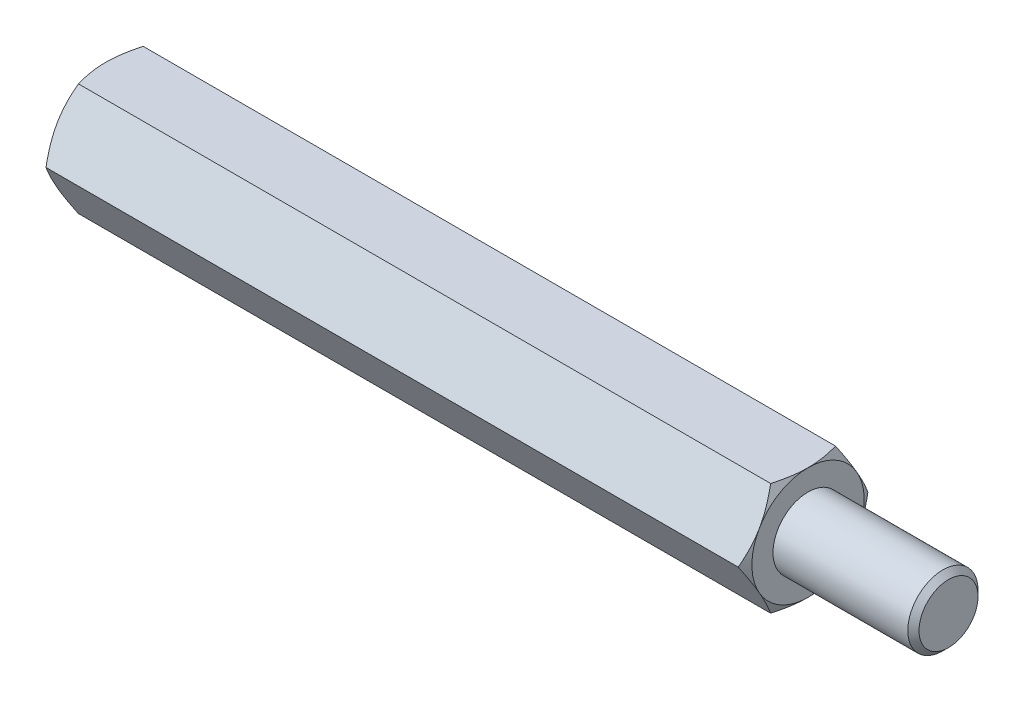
ISO-10303-21;
HEADER;
FILE_DESCRIPTION(('STEP AP214'),'2;1');
FILE_NAME('part.step','',(''),(''),'','','');
FILE_SCHEMA(('AUTOMOTIVE_DESIGN { 1 0 10303 214 1 1 1 1 }'));
ENDSEC;
DATA;
#1=APPLICATION_CONTEXT('core data for automotive mechanical design processes');
#2=APPLICATION_PROTOCOL_DEFINITION('international standard','automotive_design',2000,#1);
#3=PRODUCT_CONTEXT('',#1,'mechanical');
#4=PRODUCT('Part','Part','',(#3));
#5=PRODUCT_RELATED_PRODUCT_CATEGORY('part','',(#4));
#6=PRODUCT_DEFINITION_FORMATION('','',#4);
#7=PRODUCT_DEFINITION_CONTEXT('part definition',#1,'design');
#8=PRODUCT_DEFINITION('design','',#6,#7);
#9=PRODUCT_DEFINITION_SHAPE('','',#8);
#10=(LENGTH_UNIT() NAMED_UNIT(*) SI_UNIT(.MILLI.,.METRE.));
#11=(NAMED_UNIT(*) PLANE_ANGLE_UNIT() SI_UNIT($,.RADIAN.));
#12=(NAMED_UNIT(*) SI_UNIT($,.STERADIAN.) SOLID_ANGLE_UNIT());
#13=UNCERTAINTY_MEASURE_WITH_UNIT(LENGTH_MEASURE(1.E-05),#10,'distance_accuracy_value','');
#14=(GEOMETRIC_REPRESENTATION_CONTEXT(3) GLOBAL_UNCERTAINTY_ASSIGNED_CONTEXT((#13)) GLOBAL_UNIT_ASSIGNED_CONTEXT((#10,
#11,#12)) REPRESENTATION_CONTEXT('',''));
#15=CARTESIAN_POINT('',(0.,0.,0.));
#16=DIRECTION('',(0.,0.,1.));
#17=DIRECTION('',(1.,0.,0.));
#18=AXIS2_PLACEMENT_3D('',#15,#16,#17);
#19=CARTESIAN_POINT('',(25.,4.,-2.3094010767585));
#20=DIRECTION('',(1.,0.,0.));
#21=DIRECTION('',(0.,0.,-1.));
#22=AXIS2_PLACEMENT_3D('',#19,#20,#21);
#23=PLANE('',#22);
#24=CARTESIAN_POINT('',(25.,0.,0.));
#25=DIRECTION('',(1.,0.,0.));
#26=DIRECTION('',(0.,0.,-1.));
#27=AXIS2_PLACEMENT_3D('',#24,#25,#26);
#28=CIRCLE('',#27,4.);
#29=CARTESIAN_POINT('',(25.,-2.,-3.46410161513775));
#30=VERTEX_POINT('',#29);
#31=CARTESIAN_POINT('',(25.,2.,-3.46410161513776));
#32=VERTEX_POINT('',#31);
#33=EDGE_CURVE('E288',#30,#32,#28,.T.);
#34=ORIENTED_EDGE('',*,*,#33,.T.);
#35=CARTESIAN_POINT('',(25.,4.,0.));
#36=VERTEX_POINT('',#35);
#37=EDGE_CURVE('E53',#32,#36,#28,.T.);
#38=ORIENTED_EDGE('',*,*,#37,.T.);
#39=CARTESIAN_POINT('',(25.,2.,3.46410161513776));
#40=VERTEX_POINT('',#39);
#41=EDGE_CURVE('E296',#36,#40,#28,.T.);
#42=ORIENTED_EDGE('',*,*,#41,.T.);
#43=CARTESIAN_POINT('',(25.,-2.00000000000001,3.46410161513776));
#44=VERTEX_POINT('',#43);
#45=EDGE_CURVE('E301',#40,#44,#28,.T.);
#46=ORIENTED_EDGE('',*,*,#45,.T.);
#47=CARTESIAN_POINT('',(25.,0.,0.));
#48=DIRECTION('',(-1.,0.,0.));
#49=DIRECTION('',(0.,-1.,0.));
#50=AXIS2_PLACEMENT_3D('',#47,#48,#49);
#51=CIRCLE('',#50,4.);
#52=CARTESIAN_POINT('',(25.,-4.00000000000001,0.));
#53=VERTEX_POINT('',#52);
#54=EDGE_CURVE('E193',#53,#44,#51,.T.);
#55=ORIENTED_EDGE('',*,*,#54,.F.);
#56=EDGE_CURVE('E61',#53,#30,#28,.T.);
#57=ORIENTED_EDGE('',*,*,#56,.T.);
#58=EDGE_LOOP('',(#34,#38,#42,#46,#55,#57));
#59=FACE_BOUND('',#58,.T.);
#60=CARTESIAN_POINT('',(25.,0.,0.));
#61=DIRECTION('',(1.,0.,0.));
#62=DIRECTION('',(0.,0.,-1.));
#63=AXIS2_PLACEMENT_3D('',#60,#61,#62);
#64=CIRCLE('',#63,2.5);
#65=CARTESIAN_POINT('',(25.,0.,-2.5));
#66=VERTEX_POINT('',#65);
#67=EDGE_CURVE('E323',#66,#66,#64,.T.);
#68=ORIENTED_EDGE('',*,*,#67,.F.);
#69=EDGE_LOOP('',(#68));
#70=FACE_BOUND('',#69,.T.);
#71=ADVANCED_FACE('F37',(#59,#70),#23,.T.);
#72=CARTESIAN_POINT('',(25.,0.,-4.61880215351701));
#73=DIRECTION('',(0.,-0.5,0.866025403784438));
#74=DIRECTION('',(0.,-0.866025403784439,-0.5));
#75=AXIS2_PLACEMENT_3D('',#72,#73,#74);
#76=PLANE('',#75);
#77=CARTESIAN_POINT('',(24.6426677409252,-0.000200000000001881,-4.61891762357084));
#78=CARTESIAN_POINT('',(24.7012821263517,0.175579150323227,-4.5174314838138));
#79=CARTESIAN_POINT('',(24.7545896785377,0.352875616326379,-4.41506932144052));
#80=CARTESIAN_POINT('',(24.8476383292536,0.710538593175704,-4.2085725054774));
#81=CARTESIAN_POINT('',(24.8873465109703,0.890911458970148,-4.10443418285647));
#82=CARTESIAN_POINT('',(24.9491577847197,1.24942181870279,-3.89744813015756));
#83=CARTESIAN_POINT('',(24.9716722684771,1.42750415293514,-3.79463224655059));
#84=CARTESIAN_POINT('',(24.9985493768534,1.78450671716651,-3.58851671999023));
#85=CARTESIAN_POINT('',(25.0029342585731,1.9634256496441,-3.48521782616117));
#86=CARTESIAN_POINT('',(24.99380992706,2.29774284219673,-3.29219970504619));
#87=CARTESIAN_POINT('',(24.982541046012,2.45319115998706,-3.20245157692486));
#88=CARTESIAN_POINT('',(24.9468260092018,2.76307505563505,-3.02354002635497));
#89=CARTESIAN_POINT('',(24.9223676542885,2.91750956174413,-2.93437722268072));
#90=CARTESIAN_POINT('',(24.8612239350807,3.22803232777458,-2.75509682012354));
#91=CARTESIAN_POINT('',(24.8242793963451,3.3840812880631,-2.6650019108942));
#92=CARTESIAN_POINT('',(24.740429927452,3.69385183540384,-2.486155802));
#93=CARTESIAN_POINT('',(24.6935446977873,3.84757739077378,-2.39740231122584));
#94=CARTESIAN_POINT('',(24.6426677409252,4.0002,-2.30928560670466));
#95=B_SPLINE_CURVE_WITH_KNOTS('',3,(#77,#78,#79,#80,#81,#82,#83,#84,#85,#86,#87,#88,#89,#90,#91,
#92,#93,#94),.UNSPECIFIED.,.F.,.F.,(4,2,2,2,2,2,2,2,4),(0.,0.634047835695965,1.26961969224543,
1.88946157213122,2.50854226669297,3.04757825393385,3.58711366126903,4.13861653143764,
4.68903648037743),.UNSPECIFIED.);
#96=CARTESIAN_POINT('',(24.6427344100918,0.,-4.61880215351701));
#97=VERTEX_POINT('',#96);
#98=EDGE_CURVE('E330',#97,#32,#95,.T.);
#99=ORIENTED_EDGE('',*,*,#98,.F.);
#100=DIRECTION('',(-1.,0.,0.));
#101=VECTOR('',#100,1.);
#102=CARTESIAN_POINT('',(25.,0.,-4.61880215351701));
#103=LINE('',#102,#101);
#104=CARTESIAN_POINT('',(-24.6427344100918,0.,-4.61880215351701));
#105=VERTEX_POINT('',#104);
#106=EDGE_CURVE('E264',#97,#105,#103,.T.);
#107=ORIENTED_EDGE('',*,*,#106,.T.);
#108=CARTESIAN_POINT('',(-24.6426677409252,4.0002,-2.30928560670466));
#109=CARTESIAN_POINT('',(-24.7012821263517,3.82442084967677,-2.4107717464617));
#110=CARTESIAN_POINT('',(-24.7545896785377,3.64712438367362,-2.51313390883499));
#111=CARTESIAN_POINT('',(-24.8476383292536,3.28946140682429,-2.71963072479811));
#112=CARTESIAN_POINT('',(-24.8873465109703,3.10908854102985,-2.82376904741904));
#113=CARTESIAN_POINT('',(-24.9491577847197,2.75057818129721,-3.03075510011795));
#114=CARTESIAN_POINT('',(-24.9716722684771,2.57249584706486,-3.13357098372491));
#115=CARTESIAN_POINT('',(-24.9985493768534,2.21549328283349,-3.33968651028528));
#116=CARTESIAN_POINT('',(-25.0029342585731,2.0365743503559,-3.44298540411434));
#117=CARTESIAN_POINT('',(-24.99380992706,1.70225715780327,-3.63600352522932));
#118=CARTESIAN_POINT('',(-24.982541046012,1.54680884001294,-3.72575165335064));
#119=CARTESIAN_POINT('',(-24.9468260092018,1.23692494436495,-3.90466320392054));
#120=CARTESIAN_POINT('',(-24.9223676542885,1.08249043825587,-3.99382600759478));
#121=CARTESIAN_POINT('',(-24.8612239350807,0.771967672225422,-4.17310641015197));
#122=CARTESIAN_POINT('',(-24.8242793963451,0.615918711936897,-4.26320131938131));
#123=CARTESIAN_POINT('',(-24.740429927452,0.306148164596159,-4.4420474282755));
#124=CARTESIAN_POINT('',(-24.6935446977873,0.152422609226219,-4.53080091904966));
#125=CARTESIAN_POINT('',(-24.6426677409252,-0.000200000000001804,-4.61891762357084));
#126=B_SPLINE_CURVE_WITH_KNOTS('',3,(#108,#109,#110,#111,#112,#113,#114,#115,#116,#117,#118,
#119,#120,#121,#122,#123,#124,#125),.UNSPECIFIED.,.F.,.F.,(4,2,2,2,2,2,2,2,4),(0.,
0.634047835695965,1.26961969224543,1.88946157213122,2.50854226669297,3.04757825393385,
3.58711366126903,4.13861653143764,4.68903648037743),.UNSPECIFIED.);
#127=CARTESIAN_POINT('',(-25.,2.,-3.46410161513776));
#128=VERTEX_POINT('',#127);
#129=EDGE_CURVE('E409',#128,#105,#126,.T.);
#130=ORIENTED_EDGE('',*,*,#129,.F.);
#131=CARTESIAN_POINT('',(-24.6427344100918,4.,-2.3094010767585));
#132=VERTEX_POINT('',#131);
#133=EDGE_CURVE('E375',#132,#128,#126,.T.);
#134=ORIENTED_EDGE('',*,*,#133,.F.);
#135=DIRECTION('',(-1.,0.,0.));
#136=VECTOR('',#135,1.);
#137=CARTESIAN_POINT('',(25.,4.,-2.3094010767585));
#138=LINE('',#137,#136);
#139=CARTESIAN_POINT('',(24.642734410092,4.,-2.30940107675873));
#140=VERTEX_POINT('',#139);
#141=EDGE_CURVE('E279',#140,#132,#138,.T.);
#142=ORIENTED_EDGE('',*,*,#141,.F.);
#143=EDGE_CURVE('E229',#32,#140,#95,.T.);
#144=ORIENTED_EDGE('',*,*,#143,.F.);
#145=EDGE_LOOP('',(#99,#107,#130,#134,#142,#144));
#146=FACE_BOUND('',#145,.T.);
#147=ADVANCED_FACE('F148',(#146),#76,.F.);
#148=CARTESIAN_POINT('',(25.,4.,-2.3094010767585));
#149=DIRECTION('',(0.,-1.,0.));
#150=DIRECTION('',(0.,0.,-1.));
#151=AXIS2_PLACEMENT_3D('',#148,#149,#150);
#152=PLANE('',#151);
#153=CARTESIAN_POINT('',(23.0082907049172,4.,-6.28479524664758));
#154=CARTESIAN_POINT('',(23.0937006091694,4.,-6.10939349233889));
#155=CARTESIAN_POINT('',(23.1783148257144,4.,-5.93359774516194));
#156=CARTESIAN_POINT('',(23.3455059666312,4.,-5.58100905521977));
#157=CARTESIAN_POINT('',(23.4280825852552,4.,-5.40421596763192));
#158=CARTESIAN_POINT('',(23.5911508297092,4.,-5.04855089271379));
#159=CARTESIAN_POINT('',(23.6716293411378,4.,-4.86967287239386));
#160=CARTESIAN_POINT('',(23.829400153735,4.,-4.51052237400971));
#161=CARTESIAN_POINT('',(23.906692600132,4.,-4.33024995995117));
#162=CARTESIAN_POINT('',(24.059802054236,4.,-3.96189114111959));
#163=CARTESIAN_POINT('',(24.135480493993,4.,-3.77374683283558));
#164=CARTESIAN_POINT('',(24.2813045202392,4.,-3.39528725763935));
#165=CARTESIAN_POINT('',(24.3514494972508,4.,-3.2049717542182));
#166=CARTESIAN_POINT('',(24.4844245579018,4.,-2.82219775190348));
#167=CARTESIAN_POINT('',(24.5472687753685,4.,-2.62974421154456));
#168=CARTESIAN_POINT('',(24.6636796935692,4.,-2.24207725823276));
#169=CARTESIAN_POINT('',(24.7172492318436,4.,-2.04686470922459));
#170=CARTESIAN_POINT('',(24.8123031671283,4.,-1.65467425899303));
#171=CARTESIAN_POINT('',(24.8538563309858,4.,-1.45771333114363));
#172=CARTESIAN_POINT('',(24.9225903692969,4.,-1.06125849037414));
#173=CARTESIAN_POINT('',(24.9497727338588,4.,-0.861764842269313));
#174=CARTESIAN_POINT('',(24.9872447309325,4.,-0.463879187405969));
#175=CARTESIAN_POINT('',(24.9977578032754,4.,-0.265508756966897));
#176=CARTESIAN_POINT('',(25.0015934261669,4.,0.131417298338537));
#177=CARTESIAN_POINT('',(24.9949158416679,4.,0.329972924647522));
#178=CARTESIAN_POINT('',(24.9696489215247,4.,0.664692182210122));
#179=CARTESIAN_POINT('',(24.9553708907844,4.,0.801202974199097));
#180=CARTESIAN_POINT('',(24.9195349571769,4.,1.07327201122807));
#181=CARTESIAN_POINT('',(24.8979761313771,4.,1.20883013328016));
#182=CARTESIAN_POINT('',(24.8235066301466,4.,1.61386939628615));
#183=CARTESIAN_POINT('',(24.7608149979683,4.,1.88157484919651));
#184=CARTESIAN_POINT('',(24.6515117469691,4.,2.28197262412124));
#185=CARTESIAN_POINT('',(24.612009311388,4.,2.41672443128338));
#186=CARTESIAN_POINT('',(24.5287523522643,4.,2.68492067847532));
#187=CARTESIAN_POINT('',(24.4849977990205,4.,2.81836510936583));
#188=CARTESIAN_POINT('',(24.3939510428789,4.,3.08398596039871));
#189=CARTESIAN_POINT('',(24.346659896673,4.,3.21616274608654));
#190=CARTESIAN_POINT('',(24.2491111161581,4.,3.47941134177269));
#191=CARTESIAN_POINT('',(24.1988535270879,4.,3.61048316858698));
#192=CARTESIAN_POINT('',(24.0713295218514,4.,3.93385125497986));
#193=CARTESIAN_POINT('',(23.9926014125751,4.,4.12557021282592));
#194=CARTESIAN_POINT('',(23.8309693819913,4.,4.50724553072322));
#195=CARTESIAN_POINT('',(23.7480651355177,4.,4.69720175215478));
#196=CARTESIAN_POINT('',(23.5789699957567,4.,5.07569950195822));
#197=CARTESIAN_POINT('',(23.4927782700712,4.,5.26424065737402));
#198=CARTESIAN_POINT('',(23.3178011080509,4.,5.64011758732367));
#199=CARTESIAN_POINT('',(23.2290156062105,4.,5.82745333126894));
#200=CARTESIAN_POINT('',(22.9593432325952,4.,6.38844423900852));
#201=CARTESIAN_POINT('',(22.7753561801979,4.,6.76060781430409));
#202=CARTESIAN_POINT('',(22.4019562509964,4.,7.50211228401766));
#203=CARTESIAN_POINT('',(22.2125442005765,4.,7.87145359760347));
#204=CARTESIAN_POINT('',(21.8473877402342,4.,8.57450173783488));
#205=CARTESIAN_POINT('',(21.671975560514,4.,8.90838144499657));
#206=CARTESIAN_POINT('',(21.3188097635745,4.,9.57491712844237));
#207=CARTESIAN_POINT('',(21.1410560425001,4.,9.90757304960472));
#208=CARTESIAN_POINT('',(20.7842933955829,4.,10.5709822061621));
#209=CARTESIAN_POINT('',(20.6052895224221,3.99999999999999,10.9017381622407));
#210=CARTESIAN_POINT('',(20.2459071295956,3.99999999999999,11.5624752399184));
#211=CARTESIAN_POINT('',(20.0655286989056,3.99999999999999,11.8924564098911));
#212=CARTESIAN_POINT('',(19.884642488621,3.99999999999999,12.2221569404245));
#213=B_SPLINE_CURVE_WITH_KNOTS('',3,(#153,#154,#155,#156,#157,#158,#159,#160,#161,#162,#163,
#164,#165,#166,#167,#168,#169,#170,#171,#172,#173,#174,#175,#176,#177,#178,#179,#180,#181,#182,
#183,#184,#185,#186,#187,#188,#189,#190,#191,#192,#193,#194,#195,#196,#197,#198,#199,#200,#201,
#202,#203,#204,#205,#206,#207,#208,#209,#210,#211,#212),.UNSPECIFIED.,.F.,.F.,(4,2,2,2,2,2,2,2,
2,2,2,2,2,2,2,2,2,2,2,2,2,2,2,2,2,2,2,2,2,4),(0.,0.585280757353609,1.17064881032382,
1.75906864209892,2.34746162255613,2.9557770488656,3.56415938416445,4.17134357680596,
4.77834167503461,5.38179402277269,5.98518378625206,6.58041501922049,7.17565092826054,
7.5872191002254,7.99883946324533,8.82250155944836,9.24373134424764,9.6649640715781,
10.086071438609,10.5071723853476,11.1288656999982,11.7506074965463,12.3725077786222,
12.9944237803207,14.2398211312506,15.4850297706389,16.6164791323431,17.7479788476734,
18.8762380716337,20.0044248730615),.UNSPECIFIED.);
#214=EDGE_CURVE('E227',#140,#36,#213,.T.);
#215=ORIENTED_EDGE('',*,*,#214,.F.);
#216=ORIENTED_EDGE('',*,*,#141,.T.);
#217=CARTESIAN_POINT('',(-23.0082907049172,4.,-6.28479524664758));
#218=CARTESIAN_POINT('',(-23.0937006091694,4.,-6.10939349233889));
#219=CARTESIAN_POINT('',(-23.1783148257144,4.,-5.93359774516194));
#220=CARTESIAN_POINT('',(-23.3455059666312,4.,-5.58100905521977));
#221=CARTESIAN_POINT('',(-23.4280825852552,4.,-5.40421596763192));
#222=CARTESIAN_POINT('',(-23.5911508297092,4.,-5.04855089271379));
#223=CARTESIAN_POINT('',(-23.6716293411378,4.,-4.86967287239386));
#224=CARTESIAN_POINT('',(-23.829400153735,4.,-4.51052237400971));
#225=CARTESIAN_POINT('',(-23.906692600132,4.,-4.33024995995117));
#226=CARTESIAN_POINT('',(-24.059802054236,4.,-3.96189114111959));
#227=CARTESIAN_POINT('',(-24.135480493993,4.,-3.77374683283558));
#228=CARTESIAN_POINT('',(-24.2813045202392,4.,-3.39528725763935));
#229=CARTESIAN_POINT('',(-24.3514494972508,4.,-3.2049717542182));
#230=CARTESIAN_POINT('',(-24.4844245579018,4.,-2.82219775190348));
#231=CARTESIAN_POINT('',(-24.5472687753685,4.,-2.62974421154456));
#232=CARTESIAN_POINT('',(-24.6636796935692,4.,-2.24207725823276));
#233=CARTESIAN_POINT('',(-24.7172492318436,4.,-2.04686470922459));
#234=CARTESIAN_POINT('',(-24.8123031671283,4.,-1.65467425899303));
#235=CARTESIAN_POINT('',(-24.8538563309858,4.,-1.45771333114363));
#236=CARTESIAN_POINT('',(-24.9225903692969,4.,-1.06125849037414));
#237=CARTESIAN_POINT('',(-24.9497727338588,4.,-0.861764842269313));
#238=CARTESIAN_POINT('',(-24.9872447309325,4.,-0.463879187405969));
#239=CARTESIAN_POINT('',(-24.9977578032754,4.,-0.265508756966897));
#240=CARTESIAN_POINT('',(-25.0015934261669,4.,0.131417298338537));
#241=CARTESIAN_POINT('',(-24.9949158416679,4.,0.329972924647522));
#242=CARTESIAN_POINT('',(-24.9696489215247,4.,0.664692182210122));
#243=CARTESIAN_POINT('',(-24.9553708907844,4.,0.801202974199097));
#244=CARTESIAN_POINT('',(-24.9195349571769,4.,1.07327201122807));
#245=CARTESIAN_POINT('',(-24.8979761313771,4.,1.20883013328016));
#246=CARTESIAN_POINT('',(-24.8235066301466,4.,1.61386939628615));
#247=CARTESIAN_POINT('',(-24.7608149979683,4.,1.88157484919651));
#248=CARTESIAN_POINT('',(-24.6515117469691,4.,2.28197262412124));
#249=CARTESIAN_POINT('',(-24.612009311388,4.,2.41672443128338));
#250=CARTESIAN_POINT('',(-24.5287523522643,4.,2.68492067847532));
#251=CARTESIAN_POINT('',(-24.4849977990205,4.,2.81836510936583));
#252=CARTESIAN_POINT('',(-24.3939510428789,4.,3.08398596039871));
#253=CARTESIAN_POINT('',(-24.346659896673,4.,3.21616274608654));
#254=CARTESIAN_POINT('',(-24.2491111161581,4.,3.47941134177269));
#255=CARTESIAN_POINT('',(-24.1988535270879,4.,3.61048316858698));
#256=CARTESIAN_POINT('',(-24.0713295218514,4.,3.93385125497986));
#257=CARTESIAN_POINT('',(-23.9926014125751,4.,4.12557021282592));
#258=CARTESIAN_POINT('',(-23.8309693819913,4.,4.50724553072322));
#259=CARTESIAN_POINT('',(-23.7480651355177,4.,4.69720175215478));
#260=CARTESIAN_POINT('',(-23.5789699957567,4.,5.07569950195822));
#261=CARTESIAN_POINT('',(-23.4927782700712,4.,5.26424065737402));
#262=CARTESIAN_POINT('',(-23.3178011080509,4.,5.64011758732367));
#263=CARTESIAN_POINT('',(-23.2290156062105,4.,5.82745333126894));
#264=CARTESIAN_POINT('',(-22.9593432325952,4.,6.38844423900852));
#265=CARTESIAN_POINT('',(-22.7753561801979,4.,6.76060781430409));
#266=CARTESIAN_POINT('',(-22.4019562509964,4.,7.50211228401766));
#267=CARTESIAN_POINT('',(-22.2125442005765,4.,7.87145359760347));
#268=CARTESIAN_POINT('',(-21.8473877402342,4.,8.57450173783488));
#269=CARTESIAN_POINT('',(-21.671975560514,4.,8.90838144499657));
#270=CARTESIAN_POINT('',(-21.3188097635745,4.,9.57491712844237));
#271=CARTESIAN_POINT('',(-21.1410560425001,4.,9.90757304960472));
#272=CARTESIAN_POINT('',(-20.7842933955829,4.,10.5709822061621));
#273=CARTESIAN_POINT('',(-20.6052895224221,3.99999999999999,10.9017381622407));
#274=CARTESIAN_POINT('',(-20.2459071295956,3.99999999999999,11.5624752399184));
#275=CARTESIAN_POINT('',(-20.0655286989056,3.99999999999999,11.8924564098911));
#276=CARTESIAN_POINT('',(-19.884642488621,3.99999999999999,12.2221569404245));
#277=B_SPLINE_CURVE_WITH_KNOTS('',3,(#217,#218,#219,#220,#221,#222,#223,#224,#225,#226,#227,
#228,#229,#230,#231,#232,#233,#234,#235,#236,#237,#238,#239,#240,#241,#242,#243,#244,#245,#246,
#247,#248,#249,#250,#251,#252,#253,#254,#255,#256,#257,#258,#259,#260,#261,#262,#263,#264,#265,
#266,#267,#268,#269,#270,#271,#272,#273,#274,#275,#276),.UNSPECIFIED.,.F.,.F.,(4,2,2,2,2,2,2,2,
2,2,2,2,2,2,2,2,2,2,2,2,2,2,2,2,2,2,2,2,2,4),(0.,0.585280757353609,1.17064881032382,
1.75906864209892,2.34746162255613,2.9557770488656,3.56415938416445,4.17134357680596,
4.77834167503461,5.38179402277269,5.98518378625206,6.58041501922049,7.17565092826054,
7.5872191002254,7.99883946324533,8.82250155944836,9.24373134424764,9.6649640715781,
10.086071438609,10.5071723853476,11.1288656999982,11.7506074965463,12.3725077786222,
12.9944237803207,14.2398211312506,15.4850297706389,16.6164791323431,17.7479788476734,
18.8762380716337,20.0044248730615),.UNSPECIFIED.);
#278=CARTESIAN_POINT('',(-25.,4.,0.));
#279=VERTEX_POINT('',#278);
#280=EDGE_CURVE('E241',#279,#132,#277,.F.);
#281=ORIENTED_EDGE('',*,*,#280,.F.);
#282=CARTESIAN_POINT('',(-24.6427344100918,4.,2.3094010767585));
#283=VERTEX_POINT('',#282);
#284=EDGE_CURVE('E249',#283,#279,#277,.F.);
#285=ORIENTED_EDGE('',*,*,#284,.F.);
#286=DIRECTION('',(-1.,0.,0.));
#287=VECTOR('',#286,1.);
#288=CARTESIAN_POINT('',(25.,4.,2.3094010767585));
#289=LINE('',#288,#287);
#290=CARTESIAN_POINT('',(24.6427344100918,4.,2.3094010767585));
#291=VERTEX_POINT('',#290);
#292=EDGE_CURVE('E276',#291,#283,#289,.T.);
#293=ORIENTED_EDGE('',*,*,#292,.F.);
#294=EDGE_CURVE('E221',#36,#291,#213,.T.);
#295=ORIENTED_EDGE('',*,*,#294,.F.);
#296=EDGE_LOOP('',(#215,#216,#281,#285,#293,#295));
#297=FACE_BOUND('',#296,.T.);
#298=ADVANCED_FACE('F153',(#297),#152,.F.);
#299=CARTESIAN_POINT('',(25.,4.,2.3094010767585));
#300=DIRECTION('',(0.,-0.5,-0.866025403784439));
#301=DIRECTION('',(0.,0.866025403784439,-0.5));
#302=AXIS2_PLACEMENT_3D('',#299,#300,#301);
#303=PLANE('',#302);
#304=CARTESIAN_POINT('',(24.6426677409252,4.0002,2.30928560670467));
#305=CARTESIAN_POINT('',(24.7012821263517,3.82442084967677,2.41077174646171));
#306=CARTESIAN_POINT('',(24.7545896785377,3.64712438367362,2.51313390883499));
#307=CARTESIAN_POINT('',(24.8476383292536,3.28946140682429,2.71963072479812));
#308=CARTESIAN_POINT('',(24.8873465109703,3.10908854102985,2.82376904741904));
#309=CARTESIAN_POINT('',(24.9491577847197,2.75057818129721,3.03075510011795));
#310=CARTESIAN_POINT('',(24.9716722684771,2.57249584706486,3.13357098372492));
#311=CARTESIAN_POINT('',(24.9985493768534,2.21549328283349,3.33968651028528));
#312=CARTESIAN_POINT('',(25.0029342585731,2.0365743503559,3.44298540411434));
#313=CARTESIAN_POINT('',(24.99380992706,1.70225715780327,3.63600352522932));
#314=CARTESIAN_POINT('',(24.982541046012,1.54680884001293,3.72575165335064));
#315=CARTESIAN_POINT('',(24.9468260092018,1.23692494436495,3.90466320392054));
#316=CARTESIAN_POINT('',(24.9223676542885,1.08249043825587,3.99382600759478));
#317=CARTESIAN_POINT('',(24.8612239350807,0.771967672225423,4.17310641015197));
#318=CARTESIAN_POINT('',(24.8242793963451,0.615918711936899,4.26320131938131));
#319=CARTESIAN_POINT('',(24.740429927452,0.306148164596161,4.4420474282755));
#320=CARTESIAN_POINT('',(24.6935446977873,0.152422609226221,4.53080091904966));
#321=CARTESIAN_POINT('',(24.6426677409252,-0.000199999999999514,4.61891762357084));
#322=B_SPLINE_CURVE_WITH_KNOTS('',3,(#304,#305,#306,#307,#308,#309,#310,#311,#312,#313,#314,
#315,#316,#317,#318,#319,#320,#321),.UNSPECIFIED.,.F.,.F.,(4,2,2,2,2,2,2,2,4),(0.,
0.634047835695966,1.26961969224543,1.88946157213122,2.50854226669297,3.04757825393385,
3.58711366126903,4.13861653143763,4.68903648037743),.UNSPECIFIED.);
#323=EDGE_CURVE('E228',#291,#40,#322,.T.);
#324=ORIENTED_EDGE('',*,*,#323,.F.);
#325=ORIENTED_EDGE('',*,*,#292,.T.);
#326=CARTESIAN_POINT('',(-24.6426677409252,-0.000199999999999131,4.61891762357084));
#327=CARTESIAN_POINT('',(-24.7012821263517,0.175579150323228,4.5174314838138));
#328=CARTESIAN_POINT('',(-24.7545896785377,0.352875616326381,4.41506932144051));
#329=CARTESIAN_POINT('',(-24.8476383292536,0.710538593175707,4.20857250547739));
#330=CARTESIAN_POINT('',(-24.8873465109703,0.890911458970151,4.10443418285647));
#331=CARTESIAN_POINT('',(-24.9491577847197,1.24942181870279,3.89744813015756));
#332=CARTESIAN_POINT('',(-24.9716722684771,1.42750415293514,3.79463224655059));
#333=CARTESIAN_POINT('',(-24.9985493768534,1.78450671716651,3.58851671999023));
#334=CARTESIAN_POINT('',(-25.0029342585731,1.9634256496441,3.48521782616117));
#335=CARTESIAN_POINT('',(-24.99380992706,2.29774284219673,3.29219970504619));
#336=CARTESIAN_POINT('',(-24.982541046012,2.45319115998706,3.20245157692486));
#337=CARTESIAN_POINT('',(-24.9468260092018,2.76307505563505,3.02354002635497));
#338=CARTESIAN_POINT('',(-24.9223676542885,2.91750956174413,2.93437722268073));
#339=CARTESIAN_POINT('',(-24.8612239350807,3.22803232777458,2.75509682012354));
#340=CARTESIAN_POINT('',(-24.8242793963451,3.3840812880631,2.6650019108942));
#341=CARTESIAN_POINT('',(-24.740429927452,3.69385183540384,2.48615580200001));
#342=CARTESIAN_POINT('',(-24.6935446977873,3.84757739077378,2.39740231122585));
#343=CARTESIAN_POINT('',(-24.6426677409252,4.0002,2.30928560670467));
#344=B_SPLINE_CURVE_WITH_KNOTS('',3,(#326,#327,#328,#329,#330,#331,#332,#333,#334,#335,#336,
#337,#338,#339,#340,#341,#342,#343),.UNSPECIFIED.,.F.,.F.,(4,2,2,2,2,2,2,2,4),(0.,
0.634047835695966,1.26961969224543,1.88946157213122,2.50854226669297,3.04757825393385,
3.58711366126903,4.13861653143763,4.68903648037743),.UNSPECIFIED.);
#345=CARTESIAN_POINT('',(-25.,2.,3.46410161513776));
#346=VERTEX_POINT('',#345);
#347=EDGE_CURVE('E255',#346,#283,#344,.T.);
#348=ORIENTED_EDGE('',*,*,#347,.F.);
#349=CARTESIAN_POINT('',(-24.6427344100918,0.,4.618802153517));
#350=VERTEX_POINT('',#349);
#351=EDGE_CURVE('E262',#350,#346,#344,.T.);
#352=ORIENTED_EDGE('',*,*,#351,.F.);
#353=DIRECTION('',(-1.,0.,0.));
#354=VECTOR('',#353,1.);
#355=CARTESIAN_POINT('',(25.,0.,4.618802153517));
#356=LINE('',#355,#354);
#357=CARTESIAN_POINT('',(24.6427344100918,0.,4.618802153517));
#358=VERTEX_POINT('',#357);
#359=EDGE_CURVE('E273',#358,#350,#356,.T.);
#360=ORIENTED_EDGE('',*,*,#359,.F.);
#361=EDGE_CURVE('E215',#40,#358,#322,.T.);
#362=ORIENTED_EDGE('',*,*,#361,.F.);
#363=EDGE_LOOP('',(#324,#325,#348,#352,#360,#362));
#364=FACE_BOUND('',#363,.T.);
#365=ADVANCED_FACE('F235',(#364),#303,.F.);
#366=CARTESIAN_POINT('',(25.,0.,4.618802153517));
#367=DIRECTION('',(0.,0.5,-0.866025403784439));
#368=DIRECTION('',(0.,0.866025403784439,0.5));
#369=AXIS2_PLACEMENT_3D('',#366,#367,#368);
#370=PLANE('',#369);
#371=CARTESIAN_POINT('',(24.6426677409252,0.00020000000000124,4.61891762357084));
#372=CARTESIAN_POINT('',(24.7012821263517,-0.175579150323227,4.5174314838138));
#373=CARTESIAN_POINT('',(24.7545896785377,-0.352875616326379,4.41506932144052));
#374=CARTESIAN_POINT('',(24.8476383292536,-0.710538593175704,4.20857250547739));
#375=CARTESIAN_POINT('',(24.8873465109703,-0.890911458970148,4.10443418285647));
#376=CARTESIAN_POINT('',(24.9491577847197,-1.24942181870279,3.89744813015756));
#377=CARTESIAN_POINT('',(24.9716722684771,-1.42750415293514,3.79463224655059));
#378=CARTESIAN_POINT('',(24.9985493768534,-1.78450671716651,3.58851671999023));
#379=CARTESIAN_POINT('',(25.0029342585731,-1.9634256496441,3.48521782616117));
#380=CARTESIAN_POINT('',(24.99380992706,-2.29774284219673,3.29219970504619));
#381=CARTESIAN_POINT('',(24.982541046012,-2.45319115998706,3.20245157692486));
#382=CARTESIAN_POINT('',(24.9468260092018,-2.76307505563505,3.02354002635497));
#383=CARTESIAN_POINT('',(24.9223676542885,-2.91750956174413,2.93437722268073));
#384=CARTESIAN_POINT('',(24.8612239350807,-3.22803232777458,2.75509682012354));
#385=CARTESIAN_POINT('',(24.8242793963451,-3.3840812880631,2.6650019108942));
#386=CARTESIAN_POINT('',(24.740429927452,-3.69385183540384,2.48615580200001));
#387=CARTESIAN_POINT('',(24.6935446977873,-3.84757739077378,2.39740231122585));
#388=CARTESIAN_POINT('',(24.6426677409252,-4.0002,2.30928560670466));
#389=B_SPLINE_CURVE_WITH_KNOTS('',3,(#371,#372,#373,#374,#375,#376,#377,#378,#379,#380,#381,
#382,#383,#384,#385,#386,#387,#388),.UNSPECIFIED.,.F.,.F.,(4,2,2,2,2,2,2,2,4),(0.,
0.634047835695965,1.26961969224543,1.88946157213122,2.50854226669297,3.04757825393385,
3.58711366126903,4.13861653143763,4.68903648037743),.UNSPECIFIED.);
#390=EDGE_CURVE('E350',#358,#44,#389,.T.);
#391=ORIENTED_EDGE('',*,*,#390,.F.);
#392=ORIENTED_EDGE('',*,*,#359,.T.);
#393=CARTESIAN_POINT('',(-24.6426677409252,-4.0002,2.30928560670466));
#394=CARTESIAN_POINT('',(-24.7012821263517,-3.82442084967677,2.4107717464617));
#395=CARTESIAN_POINT('',(-24.7545896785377,-3.64712438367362,2.51313390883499));
#396=CARTESIAN_POINT('',(-24.8476383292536,-3.2894614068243,2.71963072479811));
#397=CARTESIAN_POINT('',(-24.8873465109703,-3.10908854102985,2.82376904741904));
#398=CARTESIAN_POINT('',(-24.9491577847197,-2.75057818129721,3.03075510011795));
#399=CARTESIAN_POINT('',(-24.9716722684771,-2.57249584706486,3.13357098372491));
#400=CARTESIAN_POINT('',(-24.9985493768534,-2.2154932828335,3.33968651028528));
#401=CARTESIAN_POINT('',(-25.0029342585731,-2.03657435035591,3.44298540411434));
#402=CARTESIAN_POINT('',(-24.99380992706,-1.70225715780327,3.63600352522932));
#403=CARTESIAN_POINT('',(-24.982541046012,-1.54680884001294,3.72575165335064));
#404=CARTESIAN_POINT('',(-24.9468260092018,-1.23692494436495,3.90466320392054));
#405=CARTESIAN_POINT('',(-24.9223676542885,-1.08249043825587,3.99382600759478));
#406=CARTESIAN_POINT('',(-24.8612239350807,-0.771967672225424,4.17310641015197));
#407=CARTESIAN_POINT('',(-24.8242793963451,-0.615918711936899,4.26320131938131));
#408=CARTESIAN_POINT('',(-24.740429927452,-0.306148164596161,4.4420474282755));
#409=CARTESIAN_POINT('',(-24.6935446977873,-0.152422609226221,4.53080091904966));
#410=CARTESIAN_POINT('',(-24.6426677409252,0.000200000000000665,4.61891762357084));
#411=B_SPLINE_CURVE_WITH_KNOTS('',3,(#393,#394,#395,#396,#397,#398,#399,#400,#401,#402,#403,
#404,#405,#406,#407,#408,#409,#410),.UNSPECIFIED.,.F.,.F.,(4,2,2,2,2,2,2,2,4),(0.,
0.634047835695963,1.26961969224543,1.88946157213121,2.50854226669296,3.04757825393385,
3.58711366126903,4.13861653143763,4.68903648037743),.UNSPECIFIED.);
#412=CARTESIAN_POINT('',(-25.,-2.00000000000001,3.46410161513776));
#413=VERTEX_POINT('',#412);
#414=EDGE_CURVE('E263',#413,#350,#411,.T.);
#415=ORIENTED_EDGE('',*,*,#414,.F.);
#416=CARTESIAN_POINT('',(-24.6427344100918,-4.,2.3094010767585));
#417=VERTEX_POINT('',#416);
#418=EDGE_CURVE('E250',#417,#413,#411,.T.);
#419=ORIENTED_EDGE('',*,*,#418,.F.);
#420=DIRECTION('',(-1.,0.,0.));
#421=VECTOR('',#420,1.);
#422=CARTESIAN_POINT('',(25.,-4.,2.3094010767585));
#423=LINE('',#422,#421);
#424=CARTESIAN_POINT('',(24.6427344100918,-4.,2.3094010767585));
#425=VERTEX_POINT('',#424);
#426=EDGE_CURVE('E270',#425,#417,#423,.T.);
#427=ORIENTED_EDGE('',*,*,#426,.F.);
#428=EDGE_CURVE('E210',#44,#425,#389,.T.);
#429=ORIENTED_EDGE('',*,*,#428,.F.);
#430=EDGE_LOOP('',(#391,#392,#415,#419,#427,#429));
#431=FACE_BOUND('',#430,.T.);
#432=ADVANCED_FACE('F445',(#431),#370,.F.);
#433=CARTESIAN_POINT('',(25.,-4.,2.3094010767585));
#434=DIRECTION('',(0.,1.,0.));
#435=DIRECTION('',(0.,0.,1.));
#436=AXIS2_PLACEMENT_3D('',#433,#434,#435);
#437=PLANE('',#436);
#438=CARTESIAN_POINT('',(23.0082907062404,-4.,-6.28479524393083));
#439=CARTESIAN_POINT('',(23.0937006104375,-4.,-6.10939348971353));
#440=CARTESIAN_POINT('',(23.1783148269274,-4.,-5.93359774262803));
#441=CARTESIAN_POINT('',(23.3455059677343,-4.,-5.58100905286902));
#442=CARTESIAN_POINT('',(23.4280825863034,-4.,-5.4042159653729));
#443=CARTESIAN_POINT('',(23.5911508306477,-4.,-5.04855089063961));
#444=CARTESIAN_POINT('',(23.6716293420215,-4.,-4.8696728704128));
#445=CARTESIAN_POINT('',(23.8294001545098,-4.,-4.51052237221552));
#446=CARTESIAN_POINT('',(23.9066926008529,-4.,-4.33024995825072));
#447=CARTESIAN_POINT('',(24.0598020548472,-4.,-3.96189113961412));
#448=CARTESIAN_POINT('',(24.1354804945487,-4.,-3.77374683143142));
#449=CARTESIAN_POINT('',(24.2813045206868,-4.,-3.39528725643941));
#450=CARTESIAN_POINT('',(24.3514494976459,-4.,-3.20497175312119));
#451=CARTESIAN_POINT('',(24.4844245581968,-4.,-2.82219775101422));
#452=CARTESIAN_POINT('',(24.5472687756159,-4.,-2.62974421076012));
#453=CARTESIAN_POINT('',(24.6636796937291,-4.,-2.24207725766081));
#454=CARTESIAN_POINT('',(24.7172492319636,-4.,-2.0468647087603));
#455=CARTESIAN_POINT('',(24.8123031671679,-4.,-1.65467425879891));
#456=CARTESIAN_POINT('',(24.8538563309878,-4.,-1.45771333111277));
#457=CARTESIAN_POINT('',(24.9225903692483,-4.,-1.06125849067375));
#458=CARTESIAN_POINT('',(24.9497727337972,-4.,-0.861764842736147));
#459=CARTESIAN_POINT('',(24.9872447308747,-4.,-0.463879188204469));
#460=CARTESIAN_POINT('',(24.9977578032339,-4.,-0.265508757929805));
#461=CARTESIAN_POINT('',(25.0015934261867,-4.,0.131417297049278));
#462=CARTESIAN_POINT('',(24.9949158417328,-4.,0.329972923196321));
#463=CARTESIAN_POINT('',(24.9696489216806,-4.,0.664692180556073));
#464=CARTESIAN_POINT('',(24.9553708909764,-4.,0.801202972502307));
#465=CARTESIAN_POINT('',(24.9195349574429,-4.,1.07327200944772));
#466=CARTESIAN_POINT('',(24.8979761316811,-4.,1.20883013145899));
#467=CARTESIAN_POINT('',(24.8235066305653,-4.,1.6138693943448));
#468=CARTESIAN_POINT('',(24.7608149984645,-4.,1.88157484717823));
#469=CARTESIAN_POINT('',(24.6515117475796,-4.,2.28197262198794));
#470=CARTESIAN_POINT('',(24.6120093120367,-4.,2.41672442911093));
#471=CARTESIAN_POINT('',(24.5287523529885,-4.,2.68492067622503));
#472=CARTESIAN_POINT('',(24.4849977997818,-4.,2.81836510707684));
#473=CARTESIAN_POINT('',(24.3939510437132,-4.,3.0839859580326));
#474=CARTESIAN_POINT('',(24.3466598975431,-4.,3.21616274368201));
#475=CARTESIAN_POINT('',(24.2491111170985,-4.,3.47941133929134));
#476=CARTESIAN_POINT('',(24.1988535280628,-4.,3.61048316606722));
#477=CARTESIAN_POINT('',(24.0713295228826,-4.,3.93385125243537));
#478=CARTESIAN_POINT('',(23.9926014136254,-4.,4.12557021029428));
#479=CARTESIAN_POINT('',(23.830969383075,-4.,4.50724552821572));
#480=CARTESIAN_POINT('',(23.7480651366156,-4.,4.69720174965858));
#481=CARTESIAN_POINT('',(23.5789699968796,-4.,5.07569949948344));
#482=CARTESIAN_POINT('',(23.4927782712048,-4.,5.26424065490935));
#483=CARTESIAN_POINT('',(23.3178011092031,-4.,5.64011758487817));
#484=CARTESIAN_POINT('',(23.2290156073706,-4.,5.8274533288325));
#485=CARTESIAN_POINT('',(22.9593432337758,-4.,6.38844423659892));
#486=CARTESIAN_POINT('',(22.775356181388,-4.,6.76060781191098));
#487=CARTESIAN_POINT('',(22.4019562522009,-4.,7.50211228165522));
#488=CARTESIAN_POINT('',(22.2125442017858,-4.,7.87145359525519));
#489=CARTESIAN_POINT('',(21.8473877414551,-4.,8.57450173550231));
#490=CARTESIAN_POINT('',(21.671975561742,-4.,8.90838144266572));
#491=CARTESIAN_POINT('',(21.3188097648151,-4.,9.57491712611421));
#492=CARTESIAN_POINT('',(21.1410560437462,-4.,9.90757304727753));
#493=CARTESIAN_POINT('',(20.78429339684,-4.,10.5709822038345));
#494=CARTESIAN_POINT('',(20.6052895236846,-4.,10.9017381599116));
#495=CARTESIAN_POINT('',(20.2459071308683,-4.,11.562475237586));
#496=CARTESIAN_POINT('',(20.065528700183,-4.,11.8924564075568));
#497=CARTESIAN_POINT('',(19.884642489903,-4.,12.2221569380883));
#498=B_SPLINE_CURVE_WITH_KNOTS('',3,(#438,#439,#440,#441,#442,#443,#444,#445,#446,#447,#448,
#449,#450,#451,#452,#453,#454,#455,#456,#457,#458,#459,#460,#461,#462,#463,#464,#465,#466,#467,
#468,#469,#470,#471,#472,#473,#474,#475,#476,#477,#478,#479,#480,#481,#482,#483,#484,#485,#486,
#487,#488,#489,#490,#491,#492,#493,#494,#495,#496,#497),.UNSPECIFIED.,.F.,.F.,(4,2,2,2,2,2,2,2,
2,2,2,2,2,2,2,2,2,2,2,2,2,2,2,2,2,2,2,2,2,4),(0.,0.585280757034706,1.17064880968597,
1.75906864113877,2.34746162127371,2.95577704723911,3.56415938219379,4.17134357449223,
4.77834167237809,5.38179401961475,5.98518378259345,6.58041501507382,7.17565092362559,
7.58721909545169,7.99883945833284,8.82250155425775,9.24373133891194,9.6649640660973,
10.0860714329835,10.5071723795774,11.1288656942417,11.7506074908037,12.3725077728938,
12.9944237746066,14.2398211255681,15.4850297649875,16.6164791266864,17.7479788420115,
18.8762380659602,20.0044248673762),.UNSPECIFIED.);
#499=EDGE_CURVE('E357',#425,#53,#498,.F.);
#500=ORIENTED_EDGE('',*,*,#499,.F.);
#501=ORIENTED_EDGE('',*,*,#426,.T.);
#502=CARTESIAN_POINT('',(-23.0082907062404,-4.,-6.28479524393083));
#503=CARTESIAN_POINT('',(-23.0937006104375,-4.,-6.10939348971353));
#504=CARTESIAN_POINT('',(-23.1783148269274,-4.,-5.93359774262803));
#505=CARTESIAN_POINT('',(-23.3455059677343,-4.,-5.58100905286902));
#506=CARTESIAN_POINT('',(-23.4280825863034,-4.,-5.4042159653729));
#507=CARTESIAN_POINT('',(-23.5911508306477,-4.,-5.04855089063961));
#508=CARTESIAN_POINT('',(-23.6716293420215,-4.,-4.8696728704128));
#509=CARTESIAN_POINT('',(-23.8294001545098,-4.,-4.51052237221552));
#510=CARTESIAN_POINT('',(-23.9066926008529,-4.,-4.33024995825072));
#511=CARTESIAN_POINT('',(-24.0598020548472,-4.,-3.96189113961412));
#512=CARTESIAN_POINT('',(-24.1354804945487,-4.,-3.77374683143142));
#513=CARTESIAN_POINT('',(-24.2813045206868,-4.,-3.39528725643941));
#514=CARTESIAN_POINT('',(-24.3514494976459,-4.,-3.20497175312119));
#515=CARTESIAN_POINT('',(-24.4844245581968,-4.,-2.82219775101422));
#516=CARTESIAN_POINT('',(-24.5472687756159,-4.,-2.62974421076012));
#517=CARTESIAN_POINT('',(-24.6636796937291,-4.,-2.24207725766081));
#518=CARTESIAN_POINT('',(-24.7172492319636,-4.,-2.0468647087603));
#519=CARTESIAN_POINT('',(-24.8123031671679,-4.,-1.65467425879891));
#520=CARTESIAN_POINT('',(-24.8538563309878,-4.,-1.45771333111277));
#521=CARTESIAN_POINT('',(-24.9225903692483,-4.,-1.06125849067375));
#522=CARTESIAN_POINT('',(-24.9497727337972,-4.,-0.861764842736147));
#523=CARTESIAN_POINT('',(-24.9872447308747,-4.,-0.463879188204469));
#524=CARTESIAN_POINT('',(-24.9977578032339,-4.,-0.265508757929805));
#525=CARTESIAN_POINT('',(-25.0015934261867,-4.,0.131417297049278));
#526=CARTESIAN_POINT('',(-24.9949158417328,-4.,0.329972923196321));
#527=CARTESIAN_POINT('',(-24.9696489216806,-4.,0.664692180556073));
#528=CARTESIAN_POINT('',(-24.9553708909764,-4.,0.801202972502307));
#529=CARTESIAN_POINT('',(-24.9195349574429,-4.,1.07327200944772));
#530=CARTESIAN_POINT('',(-24.8979761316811,-4.,1.20883013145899));
#531=CARTESIAN_POINT('',(-24.8235066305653,-4.,1.6138693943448));
#532=CARTESIAN_POINT('',(-24.7608149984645,-4.,1.88157484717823));
#533=CARTESIAN_POINT('',(-24.6515117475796,-4.,2.28197262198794));
#534=CARTESIAN_POINT('',(-24.6120093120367,-4.,2.41672442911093));
#535=CARTESIAN_POINT('',(-24.5287523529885,-4.,2.68492067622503));
#536=CARTESIAN_POINT('',(-24.4849977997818,-4.,2.81836510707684));
#537=CARTESIAN_POINT('',(-24.3939510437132,-4.,3.0839859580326));
#538=CARTESIAN_POINT('',(-24.3466598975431,-4.,3.21616274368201));
#539=CARTESIAN_POINT('',(-24.2491111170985,-4.,3.47941133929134));
#540=CARTESIAN_POINT('',(-24.1988535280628,-4.,3.61048316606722));
#541=CARTESIAN_POINT('',(-24.0713295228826,-4.,3.93385125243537));
#542=CARTESIAN_POINT('',(-23.9926014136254,-4.,4.12557021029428));
#543=CARTESIAN_POINT('',(-23.830969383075,-4.,4.50724552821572));
#544=CARTESIAN_POINT('',(-23.7480651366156,-4.,4.69720174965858));
#545=CARTESIAN_POINT('',(-23.5789699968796,-4.,5.07569949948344));
#546=CARTESIAN_POINT('',(-23.4927782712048,-4.,5.26424065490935));
#547=CARTESIAN_POINT('',(-23.3178011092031,-4.,5.64011758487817));
#548=CARTESIAN_POINT('',(-23.2290156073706,-4.,5.8274533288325));
#549=CARTESIAN_POINT('',(-22.9593432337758,-4.,6.38844423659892));
#550=CARTESIAN_POINT('',(-22.775356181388,-4.,6.76060781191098));
#551=CARTESIAN_POINT('',(-22.4019562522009,-4.,7.50211228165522));
#552=CARTESIAN_POINT('',(-22.2125442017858,-4.,7.87145359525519));
#553=CARTESIAN_POINT('',(-21.8473877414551,-4.,8.57450173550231));
#554=CARTESIAN_POINT('',(-21.671975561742,-4.,8.90838144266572));
#555=CARTESIAN_POINT('',(-21.3188097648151,-4.,9.57491712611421));
#556=CARTESIAN_POINT('',(-21.1410560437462,-4.,9.90757304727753));
#557=CARTESIAN_POINT('',(-20.78429339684,-4.,10.5709822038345));
#558=CARTESIAN_POINT('',(-20.6052895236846,-4.,10.9017381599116));
#559=CARTESIAN_POINT('',(-20.2459071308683,-4.,11.562475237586));
#560=CARTESIAN_POINT('',(-20.065528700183,-4.,11.8924564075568));
#561=CARTESIAN_POINT('',(-19.884642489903,-4.,12.2221569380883));
#562=B_SPLINE_CURVE_WITH_KNOTS('',3,(#502,#503,#504,#505,#506,#507,#508,#509,#510,#511,#512,
#513,#514,#515,#516,#517,#518,#519,#520,#521,#522,#523,#524,#525,#526,#527,#528,#529,#530,#531,
#532,#533,#534,#535,#536,#537,#538,#539,#540,#541,#542,#543,#544,#545,#546,#547,#548,#549,#550,
#551,#552,#553,#554,#555,#556,#557,#558,#559,#560,#561),.UNSPECIFIED.,.F.,.F.,(4,2,2,2,2,2,2,2,
2,2,2,2,2,2,2,2,2,2,2,2,2,2,2,2,2,2,2,2,2,4),(0.,0.585280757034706,1.17064880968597,
1.75906864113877,2.34746162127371,2.95577704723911,3.56415938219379,4.17134357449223,
4.77834167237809,5.38179401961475,5.98518378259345,6.58041501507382,7.17565092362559,
7.58721909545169,7.99883945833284,8.82250155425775,9.24373133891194,9.6649640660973,
10.0860714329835,10.5071723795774,11.1288656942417,11.7506074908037,12.3725077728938,
12.9944237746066,14.2398211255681,15.4850297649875,16.6164791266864,17.7479788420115,
18.8762380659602,20.0044248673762),.UNSPECIFIED.);
#563=CARTESIAN_POINT('',(-25.,-4.00000000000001,0.));
#564=VERTEX_POINT('',#563);
#565=EDGE_CURVE('E410',#564,#417,#562,.T.);
#566=ORIENTED_EDGE('',*,*,#565,.F.);
#567=CARTESIAN_POINT('',(-24.6427344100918,-4.,-2.3094010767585));
#568=VERTEX_POINT('',#567);
#569=EDGE_CURVE('E403',#568,#564,#562,.T.);
#570=ORIENTED_EDGE('',*,*,#569,.F.);
#571=DIRECTION('',(-1.,0.,0.));
#572=VECTOR('',#571,1.);
#573=CARTESIAN_POINT('',(25.,-4.,-2.3094010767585));
#574=LINE('',#573,#572);
#575=CARTESIAN_POINT('',(24.6427344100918,-4.,-2.3094010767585));
#576=VERTEX_POINT('',#575);
#577=EDGE_CURVE('E267',#576,#568,#574,.T.);
#578=ORIENTED_EDGE('',*,*,#577,.F.);
#579=EDGE_CURVE('E195',#53,#576,#498,.F.);
#580=ORIENTED_EDGE('',*,*,#579,.F.);
#581=EDGE_LOOP('',(#500,#501,#566,#570,#578,#580));
#582=FACE_BOUND('',#581,.T.);
#583=ADVANCED_FACE('F172',(#582),#437,.F.);
#584=CARTESIAN_POINT('',(25.,-4.,-2.3094010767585));
#585=DIRECTION('',(0.,0.5,0.866025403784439));
#586=DIRECTION('',(0.,-0.866025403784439,0.5));
#587=AXIS2_PLACEMENT_3D('',#584,#585,#586);
#588=PLANE('',#587);
#589=CARTESIAN_POINT('',(24.6426677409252,-4.0002,-2.30928560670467));
#590=CARTESIAN_POINT('',(24.7012821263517,-3.82442084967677,-2.41077174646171));
#591=CARTESIAN_POINT('',(24.7545896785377,-3.64712438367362,-2.51313390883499));
#592=CARTESIAN_POINT('',(24.8476383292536,-3.2894614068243,-2.71963072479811));
#593=CARTESIAN_POINT('',(24.8873465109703,-3.10908854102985,-2.82376904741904));
#594=CARTESIAN_POINT('',(24.9491577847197,-2.75057818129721,-3.03075510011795));
#595=CARTESIAN_POINT('',(24.9716722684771,-2.57249584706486,-3.13357098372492));
#596=CARTESIAN_POINT('',(24.9985493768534,-2.2154932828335,-3.33968651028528));
#597=CARTESIAN_POINT('',(25.0029342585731,-2.0365743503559,-3.44298540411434));
#598=CARTESIAN_POINT('',(24.99380992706,-1.70225715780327,-3.63600352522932));
#599=CARTESIAN_POINT('',(24.982541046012,-1.54680884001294,-3.72575165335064));
#600=CARTESIAN_POINT('',(24.9468260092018,-1.23692494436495,-3.90466320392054));
#601=CARTESIAN_POINT('',(24.9223676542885,-1.08249043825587,-3.99382600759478));
#602=CARTESIAN_POINT('',(24.8612239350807,-0.771967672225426,-4.17310641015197));
#603=CARTESIAN_POINT('',(24.8242793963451,-0.615918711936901,-4.26320131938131));
#604=CARTESIAN_POINT('',(24.740429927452,-0.306148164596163,-4.4420474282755));
#605=CARTESIAN_POINT('',(24.6935446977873,-0.152422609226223,-4.53080091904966));
#606=CARTESIAN_POINT('',(24.6426677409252,0.000199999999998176,-4.61891762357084));
#607=B_SPLINE_CURVE_WITH_KNOTS('',3,(#589,#590,#591,#592,#593,#594,#595,#596,#597,#598,#599,
#600,#601,#602,#603,#604,#605,#606),.UNSPECIFIED.,.F.,.F.,(4,2,2,2,2,2,2,2,4),(0.,
0.634047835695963,1.26961969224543,1.88946157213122,2.50854226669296,3.04757825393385,
3.58711366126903,4.13861653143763,4.68903648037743),.UNSPECIFIED.);
#608=EDGE_CURVE('E192',#576,#30,#607,.T.);
#609=ORIENTED_EDGE('',*,*,#608,.F.);
#610=ORIENTED_EDGE('',*,*,#577,.T.);
#611=CARTESIAN_POINT('',(-24.6426677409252,0.000199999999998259,-4.61891762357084));
#612=CARTESIAN_POINT('',(-24.7012821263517,-0.17557915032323,-4.5174314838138));
#613=CARTESIAN_POINT('',(-24.7545896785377,-0.352875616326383,-4.41506932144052));
#614=CARTESIAN_POINT('',(-24.8476383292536,-0.710538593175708,-4.20857250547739));
#615=CARTESIAN_POINT('',(-24.8873465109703,-0.890911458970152,-4.10443418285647));
#616=CARTESIAN_POINT('',(-24.9491577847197,-1.24942181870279,-3.89744813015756));
#617=CARTESIAN_POINT('',(-24.9716722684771,-1.42750415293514,-3.79463224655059));
#618=CARTESIAN_POINT('',(-24.9985493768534,-1.78450671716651,-3.58851671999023));
#619=CARTESIAN_POINT('',(-25.0029342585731,-1.9634256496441,-3.48521782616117));
#620=CARTESIAN_POINT('',(-24.99380992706,-2.29774284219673,-3.29219970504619));
#621=CARTESIAN_POINT('',(-24.982541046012,-2.45319115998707,-3.20245157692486));
#622=CARTESIAN_POINT('',(-24.9468260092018,-2.76307505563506,-3.02354002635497));
#623=CARTESIAN_POINT('',(-24.9223676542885,-2.91750956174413,-2.93437722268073));
#624=CARTESIAN_POINT('',(-24.8612239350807,-3.22803232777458,-2.75509682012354));
#625=CARTESIAN_POINT('',(-24.8242793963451,-3.3840812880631,-2.6650019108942));
#626=CARTESIAN_POINT('',(-24.740429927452,-3.69385183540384,-2.48615580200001));
#627=CARTESIAN_POINT('',(-24.6935446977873,-3.84757739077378,-2.39740231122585));
#628=CARTESIAN_POINT('',(-24.6426677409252,-4.0002,-2.30928560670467));
#629=B_SPLINE_CURVE_WITH_KNOTS('',3,(#611,#612,#613,#614,#615,#616,#617,#618,#619,#620,#621,
#622,#623,#624,#625,#626,#627,#628),.UNSPECIFIED.,.F.,.F.,(4,2,2,2,2,2,2,2,4),(0.,
0.634047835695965,1.26961969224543,1.88946157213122,2.50854226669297,3.04757825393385,
3.58711366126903,4.13861653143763,4.68903648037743),.UNSPECIFIED.);
#630=CARTESIAN_POINT('',(-25.,-2.,-3.46410161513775));
#631=VERTEX_POINT('',#630);
#632=EDGE_CURVE('E178',#631,#568,#629,.T.);
#633=ORIENTED_EDGE('',*,*,#632,.F.);
#634=EDGE_CURVE('E407',#105,#631,#629,.T.);
#635=ORIENTED_EDGE('',*,*,#634,.F.);
#636=ORIENTED_EDGE('',*,*,#106,.F.);
#637=EDGE_CURVE('E185',#30,#97,#607,.T.);
#638=ORIENTED_EDGE('',*,*,#637,.F.);
#639=EDGE_LOOP('',(#609,#610,#633,#635,#636,#638));
#640=FACE_BOUND('',#639,.T.);
#641=ADVANCED_FACE('F167',(#640),#588,.F.);
#642=CARTESIAN_POINT('',(-25.,0.,0.));
#643=DIRECTION('',(1.,0.,0.));
#644=DIRECTION('',(0.,1.,0.));
#645=AXIS2_PLACEMENT_3D('',#642,#643,#644);
#646=CONICAL_SURFACE('',#645,4.,1.04719755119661);
#647=ORIENTED_EDGE('',*,*,#129,.T.);
#648=ORIENTED_EDGE('',*,*,#634,.T.);
#649=CARTESIAN_POINT('',(-25.,0.,0.));
#650=DIRECTION('',(1.,0.,0.));
#651=DIRECTION('',(0.,0.,-1.));
#652=AXIS2_PLACEMENT_3D('',#649,#650,#651);
#653=CIRCLE('',#652,4.);
#654=EDGE_CURVE('E282',#631,#128,#653,.T.);
#655=ORIENTED_EDGE('',*,*,#654,.T.);
#656=EDGE_LOOP('',(#647,#648,#655));
#657=FACE_BOUND('',#656,.T.);
#658=ADVANCED_FACE('F171',(#657),#646,.T.);
#659=ORIENTED_EDGE('',*,*,#569,.T.);
#660=EDGE_CURVE('E286',#564,#631,#653,.T.);
#661=ORIENTED_EDGE('',*,*,#660,.T.);
#662=ORIENTED_EDGE('',*,*,#632,.T.);
#663=EDGE_LOOP('',(#659,#661,#662));
#664=FACE_BOUND('',#663,.T.);
#665=ADVANCED_FACE('F401',(#664),#646,.T.);
#666=ORIENTED_EDGE('',*,*,#418,.T.);
#667=CARTESIAN_POINT('',(-25.,0.,0.));
#668=DIRECTION('',(-1.,0.,0.));
#669=DIRECTION('',(0.,-1.,0.));
#670=AXIS2_PLACEMENT_3D('',#667,#668,#669);
#671=CIRCLE('',#670,4.);
#672=EDGE_CURVE('E331',#564,#413,#671,.T.);
#673=ORIENTED_EDGE('',*,*,#672,.F.);
#674=ORIENTED_EDGE('',*,*,#565,.T.);
#675=EDGE_LOOP('',(#666,#673,#674));
#676=FACE_BOUND('',#675,.T.);
#677=ADVANCED_FACE('F426',(#676),#646,.T.);
#678=ORIENTED_EDGE('',*,*,#351,.T.);
#679=EDGE_CURVE('E388',#346,#413,#653,.T.);
#680=ORIENTED_EDGE('',*,*,#679,.T.);
#681=ORIENTED_EDGE('',*,*,#414,.T.);
#682=EDGE_LOOP('',(#678,#680,#681));
#683=FACE_BOUND('',#682,.T.);
#684=ADVANCED_FACE('F158',(#683),#646,.T.);
#685=ORIENTED_EDGE('',*,*,#347,.T.);
#686=ORIENTED_EDGE('',*,*,#284,.T.);
#687=EDGE_CURVE('E384',#279,#346,#653,.T.);
#688=ORIENTED_EDGE('',*,*,#687,.T.);
#689=EDGE_LOOP('',(#685,#686,#688));
#690=FACE_BOUND('',#689,.T.);
#691=ADVANCED_FACE('F423',(#690),#646,.T.);
#692=ORIENTED_EDGE('',*,*,#280,.T.);
#693=ORIENTED_EDGE('',*,*,#133,.T.);
#694=EDGE_CURVE('E287',#128,#279,#653,.T.);
#695=ORIENTED_EDGE('',*,*,#694,.T.);
#696=EDGE_LOOP('',(#692,#693,#695));
#697=FACE_BOUND('',#696,.T.);
#698=ADVANCED_FACE('F165',(#697),#646,.T.);
#699=CARTESIAN_POINT('',(-25.,4.,-2.3094010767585));
#700=DIRECTION('',(1.,0.,0.));
#701=DIRECTION('',(0.,0.,-1.));
#702=AXIS2_PLACEMENT_3D('',#699,#700,#701);
#703=PLANE('',#702);
#704=CARTESIAN_POINT('',(-25.,0.,0.));
#705=DIRECTION('',(-1.,0.,0.));
#706=DIRECTION('',(0.,0.,1.));
#707=AXIS2_PLACEMENT_3D('',#704,#705,#706);
#708=CIRCLE('',#707,2.1);
#709=CARTESIAN_POINT('',(-25.,0.,2.1));
#710=VERTEX_POINT('',#709);
#711=EDGE_CURVE('E312',#710,#710,#708,.T.);
#712=ORIENTED_EDGE('',*,*,#711,.F.);
#713=EDGE_LOOP('',(#712));
#714=FACE_BOUND('',#713,.T.);
#715=ORIENTED_EDGE('',*,*,#694,.F.);
#716=ORIENTED_EDGE('',*,*,#654,.F.);
#717=ORIENTED_EDGE('',*,*,#660,.F.);
#718=ORIENTED_EDGE('',*,*,#672,.T.);
#719=ORIENTED_EDGE('',*,*,#679,.F.);
#720=ORIENTED_EDGE('',*,*,#687,.F.);
#721=EDGE_LOOP('',(#715,#716,#717,#718,#719,#720));
#722=FACE_BOUND('',#721,.T.);
#723=ADVANCED_FACE('F161',(#714,#722),#703,.F.);
#724=CARTESIAN_POINT('',(25.,0.,0.));
#725=DIRECTION('',(-1.,0.,0.));
#726=DIRECTION('',(0.,1.,0.));
#727=AXIS2_PLACEMENT_3D('',#724,#725,#726);
#728=CONICAL_SURFACE('',#727,4.,1.04719755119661);
#729=ORIENTED_EDGE('',*,*,#98,.T.);
#730=ORIENTED_EDGE('',*,*,#33,.F.);
#731=ORIENTED_EDGE('',*,*,#637,.T.);
#732=EDGE_LOOP('',(#729,#730,#731));
#733=FACE_BOUND('',#732,.T.);
#734=ADVANCED_FACE('F164',(#733),#728,.T.);
#735=ORIENTED_EDGE('',*,*,#579,.T.);
#736=ORIENTED_EDGE('',*,*,#608,.T.);
#737=ORIENTED_EDGE('',*,*,#56,.F.);
#738=EDGE_LOOP('',(#735,#736,#737));
#739=FACE_BOUND('',#738,.T.);
#740=ADVANCED_FACE('F202',(#739),#728,.T.);
#741=ORIENTED_EDGE('',*,*,#428,.T.);
#742=ORIENTED_EDGE('',*,*,#499,.T.);
#743=ORIENTED_EDGE('',*,*,#54,.T.);
#744=EDGE_LOOP('',(#741,#742,#743));
#745=FACE_BOUND('',#744,.T.);
#746=ADVANCED_FACE('F521',(#745),#728,.T.);
#747=ORIENTED_EDGE('',*,*,#361,.T.);
#748=ORIENTED_EDGE('',*,*,#390,.T.);
#749=ORIENTED_EDGE('',*,*,#45,.F.);
#750=EDGE_LOOP('',(#747,#748,#749));
#751=FACE_BOUND('',#750,.T.);
#752=ADVANCED_FACE('F348',(#751),#728,.T.);
#753=ORIENTED_EDGE('',*,*,#294,.T.);
#754=ORIENTED_EDGE('',*,*,#323,.T.);
#755=ORIENTED_EDGE('',*,*,#41,.F.);
#756=EDGE_LOOP('',(#753,#754,#755));
#757=FACE_BOUND('',#756,.T.);
#758=ADVANCED_FACE('F342',(#757),#728,.T.);
#759=ORIENTED_EDGE('',*,*,#143,.T.);
#760=ORIENTED_EDGE('',*,*,#214,.T.);
#761=ORIENTED_EDGE('',*,*,#37,.F.);
#762=EDGE_LOOP('',(#759,#760,#761));
#763=FACE_BOUND('',#762,.T.);
#764=ADVANCED_FACE('F143',(#763),#728,.T.);
#765=CARTESIAN_POINT('',(-15.,0.,0.));
#766=DIRECTION('',(-1.,0.,0.));
#767=DIRECTION('',(0.,0.,1.));
#768=AXIS2_PLACEMENT_3D('',#765,#766,#767);
#769=CYLINDRICAL_SURFACE('',#768,2.1);
#770=CARTESIAN_POINT('',(-15.,0.,0.));
#771=DIRECTION('',(1.,0.,0.));
#772=DIRECTION('',(0.,0.,-1.));
#773=AXIS2_PLACEMENT_3D('',#770,#771,#772);
#774=CIRCLE('',#773,2.1);
#775=CARTESIAN_POINT('',(-15.,0.,-2.1));
#776=VERTEX_POINT('',#775);
#777=EDGE_CURVE('E316',#776,#776,#774,.T.);
#778=ORIENTED_EDGE('',*,*,#777,.T.);
#779=EDGE_LOOP('',(#778));
#780=FACE_BOUND('',#779,.T.);
#781=ORIENTED_EDGE('',*,*,#711,.T.);
#782=EDGE_LOOP('',(#781));
#783=FACE_BOUND('',#782,.T.);
#784=ADVANCED_FACE('F133',(#780,#783),#769,.F.);
#785=CARTESIAN_POINT('',(-13.7875644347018,0.,0.));
#786=DIRECTION('',(-1.,0.,0.));
#787=DIRECTION('',(0.,0.,1.));
#788=AXIS2_PLACEMENT_3D('',#785,#786,#787);
#789=CONICAL_SURFACE('',#788,0.,1.0471975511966);
#790=ORIENTED_EDGE('',*,*,#777,.F.);
#791=EDGE_LOOP('',(#790));
#792=FACE_BOUND('',#791,.T.);
#793=CARTESIAN_POINT('',(-13.7875644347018,0.,0.));
#794=VERTEX_POINT('',#793);
#795=VERTEX_LOOP('',#794);
#796=FACE_BOUND('',#795,.T.);
#797=ADVANCED_FACE('F130',(#792,#796),#789,.F.);
#798=CARTESIAN_POINT('',(35.,0.,0.));
#799=DIRECTION('',(-1.,0.,0.));
#800=DIRECTION('',(0.,0.,1.));
#801=AXIS2_PLACEMENT_3D('',#798,#799,#800);
#802=CYLINDRICAL_SURFACE('',#801,2.5);
#803=CARTESIAN_POINT('',(34.6,0.,0.));
#804=DIRECTION('',(1.,0.,0.));
#805=DIRECTION('',(0.,0.,-1.));
#806=AXIS2_PLACEMENT_3D('',#803,#804,#805);
#807=CIRCLE('',#806,2.5);
#808=CARTESIAN_POINT('',(34.6,0.,-2.5));
#809=VERTEX_POINT('',#808);
#810=EDGE_CURVE('E11',#809,#809,#807,.F.);
#811=ORIENTED_EDGE('',*,*,#810,.T.);
#812=EDGE_LOOP('',(#811));
#813=FACE_BOUND('',#812,.T.);
#814=ORIENTED_EDGE('',*,*,#67,.T.);
#815=EDGE_LOOP('',(#814));
#816=FACE_BOUND('',#815,.T.);
#817=ADVANCED_FACE('F132',(#813,#816),#802,.T.);
#818=CARTESIAN_POINT('',(35.,0.,0.));
#819=DIRECTION('',(1.,0.,0.));
#820=DIRECTION('',(0.,0.,-1.));
#821=AXIS2_PLACEMENT_3D('',#818,#819,#820);
#822=PLANE('',#821);
#823=CARTESIAN_POINT('',(35.,0.,0.));
#824=DIRECTION('',(1.,0.,0.));
#825=DIRECTION('',(0.,0.,-1.));
#826=AXIS2_PLACEMENT_3D('',#823,#824,#825);
#827=CIRCLE('',#826,2.1);
#828=CARTESIAN_POINT('',(35.,0.,-2.1));
#829=VERTEX_POINT('',#828);
#830=EDGE_CURVE('E46',#829,#829,#827,.T.);
#831=ORIENTED_EDGE('',*,*,#830,.T.);
#832=EDGE_LOOP('',(#831));
#833=FACE_BOUND('',#832,.T.);
#834=ADVANCED_FACE('F140',(#833),#822,.T.);
#835=CARTESIAN_POINT('',(35.,0.,0.));
#836=DIRECTION('',(-1.,0.,0.));
#837=DIRECTION('',(0.,0.,1.));
#838=AXIS2_PLACEMENT_3D('',#835,#836,#837);
#839=CONICAL_SURFACE('',#838,2.1,0.785398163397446);
#840=ORIENTED_EDGE('',*,*,#810,.F.);
#841=EDGE_LOOP('',(#840));
#842=FACE_BOUND('',#841,.T.);
#843=ORIENTED_EDGE('',*,*,#830,.F.);
#844=EDGE_LOOP('',(#843));
#845=FACE_BOUND('',#844,.T.);
#846=ADVANCED_FACE('F39',(#842,#845),#839,.T.);
#847=CLOSED_SHELL('',(#71,#147,#298,#365,#432,#583,#641,#658,#665,#677,#684,#691,#698,#723,#734,
#740,#746,#752,#758,#764,#784,#797,#817,#834,#846));
#848=MANIFOLD_SOLID_BREP('B2',#847);
#849=ADVANCED_BREP_SHAPE_REPRESENTATION('',(#18,#848),#14);
#850=SHAPE_DEFINITION_REPRESENTATION(#9,#849);
ENDSEC;
END-ISO-10303-21;
